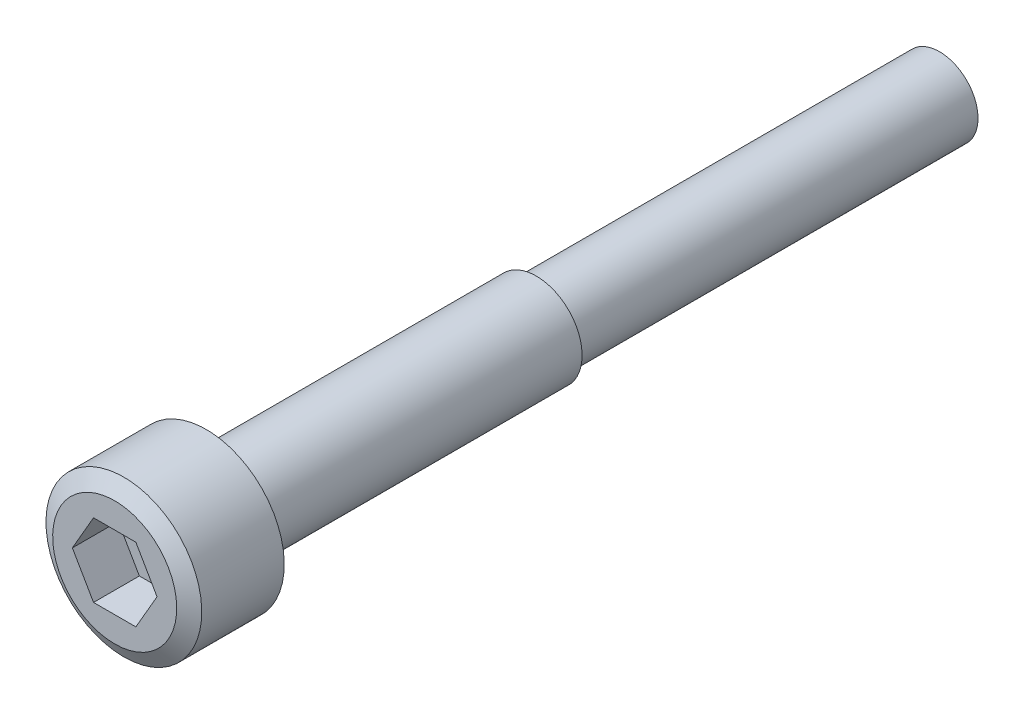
from build123d import *

# Parameters (mm, degrees)
HEX_START             = -2.500001
HEX_CUT_EXTRUDE_DEPTH = 2.500002


with BuildPart() as part:
    # SHCS Sketch → SHCS Base-Revolve (revolve)
    with BuildSketch(Plane(origin=(0, 0, 0), x_dir=(0, 0, -1), z_dir=(1, 0, 0)), mode=Mode.PRIVATE) as shcs_base_revolve_sk:
        Polygon((0, 2), (0, 3.383974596), (0.5, 4.25), (5, 4.25), (5, 2.85), (5, 2.5), (5.35, 2.5), (23, 2.5), (23, 2.1), (45, 2.1), (45, 0), (2.5, 0), (2.5, 2), align=None)
    revolve(shcs_base_revolve_sk.sketch.rotate(Axis((0, 0, 0), (0, 0, -1)), 180), axis=Axis((0, 0, 0), (0, 0, -1)))

    # Hex Sketch → Hex Cut-Extrude (cut)
    with BuildSketch(Plane.XY.offset(HEX_START)):
        Polygon((-1.154700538, 2), (1.154700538, 2), (2.309401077, 0), (1.154700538, -2), (-1.154700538, -2), (-2.309401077, 0), align=None)
    extrude(amount=HEX_CUT_EXTRUDE_DEPTH, mode=Mode.SUBTRACT)


solid = part.part
